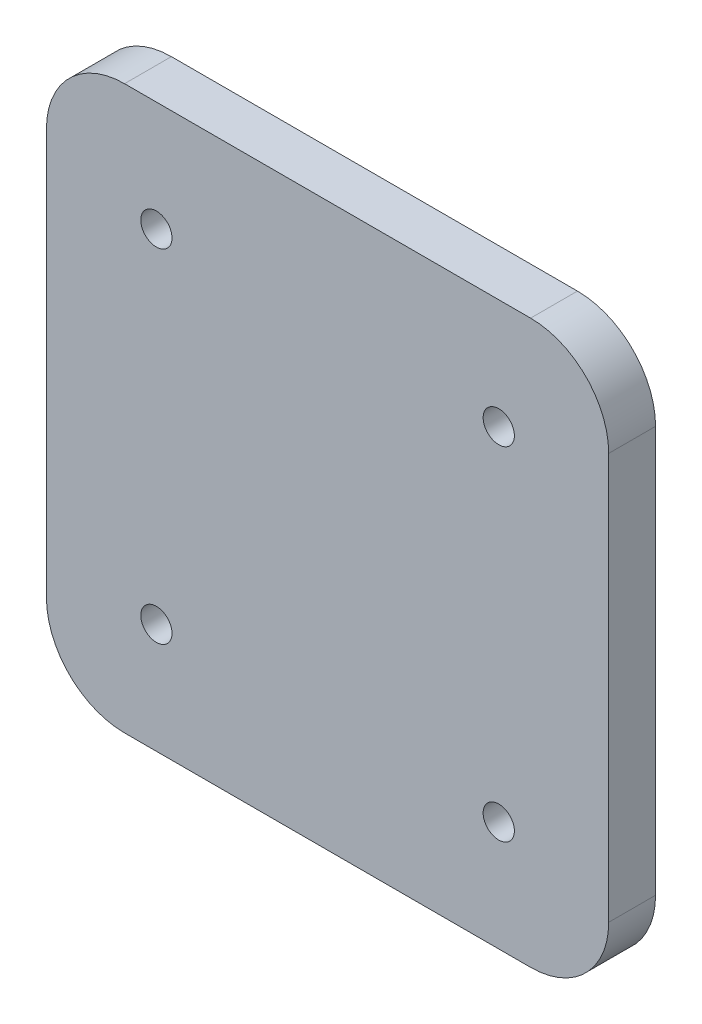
ISO-10303-21;
HEADER;
FILE_DESCRIPTION(('STEP AP214'),'2;1');
FILE_NAME('part.step','',(''),(''),'','','');
FILE_SCHEMA(('AUTOMOTIVE_DESIGN { 1 0 10303 214 1 1 1 1 }'));
ENDSEC;
DATA;
#1=APPLICATION_CONTEXT('core data for automotive mechanical design processes');
#2=APPLICATION_PROTOCOL_DEFINITION('international standard','automotive_design',2000,#1);
#3=PRODUCT_CONTEXT('',#1,'mechanical');
#4=PRODUCT('Part','Part','',(#3));
#5=PRODUCT_RELATED_PRODUCT_CATEGORY('part','',(#4));
#6=PRODUCT_DEFINITION_FORMATION('','',#4);
#7=PRODUCT_DEFINITION_CONTEXT('part definition',#1,'design');
#8=PRODUCT_DEFINITION('design','',#6,#7);
#9=PRODUCT_DEFINITION_SHAPE('','',#8);
#10=(LENGTH_UNIT() NAMED_UNIT(*) SI_UNIT(.MILLI.,.METRE.));
#11=(NAMED_UNIT(*) PLANE_ANGLE_UNIT() SI_UNIT($,.RADIAN.));
#12=(NAMED_UNIT(*) SI_UNIT($,.STERADIAN.) SOLID_ANGLE_UNIT());
#13=UNCERTAINTY_MEASURE_WITH_UNIT(LENGTH_MEASURE(1.E-05),#10,'distance_accuracy_value','');
#14=(GEOMETRIC_REPRESENTATION_CONTEXT(3) GLOBAL_UNCERTAINTY_ASSIGNED_CONTEXT((#13)) GLOBAL_UNIT_ASSIGNED_CONTEXT((#10,
#11,#12)) REPRESENTATION_CONTEXT('',''));
#15=CARTESIAN_POINT('',(0.,0.,0.));
#16=DIRECTION('',(0.,0.,1.));
#17=DIRECTION('',(1.,0.,0.));
#18=AXIS2_PLACEMENT_3D('',#15,#16,#17);
#19=CARTESIAN_POINT('',(-13.,13.,3.));
#20=DIRECTION('',(0.,0.,1.));
#21=DIRECTION('',(1.,0.,0.));
#22=AXIS2_PLACEMENT_3D('',#19,#20,#21);
#23=PLANE('',#22);
#24=CARTESIAN_POINT('',(-10.9601551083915,-10.9601551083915,3.));
#25=DIRECTION('',(0.,0.,1.));
#26=DIRECTION('',(1.,0.,0.));
#27=AXIS2_PLACEMENT_3D('',#24,#25,#26);
#28=CIRCLE('',#27,1.);
#29=CARTESIAN_POINT('',(-9.96015510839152,-10.9601551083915,3.));
#30=VERTEX_POINT('',#29);
#31=EDGE_CURVE('E188',#30,#30,#28,.T.);
#32=ORIENTED_EDGE('',*,*,#31,.F.);
#33=EDGE_LOOP('',(#32));
#34=FACE_BOUND('',#33,.T.);
#35=CARTESIAN_POINT('',(10.9601551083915,10.9601551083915,3.));
#36=DIRECTION('',(0.,0.,1.));
#37=DIRECTION('',(1.,0.,0.));
#38=AXIS2_PLACEMENT_3D('',#35,#36,#37);
#39=CIRCLE('',#38,1.);
#40=CARTESIAN_POINT('',(11.9601551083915,10.9601551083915,3.));
#41=VERTEX_POINT('',#40);
#42=EDGE_CURVE('E134',#41,#41,#39,.T.);
#43=ORIENTED_EDGE('',*,*,#42,.F.);
#44=EDGE_LOOP('',(#43));
#45=FACE_BOUND('',#44,.T.);
#46=CARTESIAN_POINT('',(-13.,13.,3.));
#47=DIRECTION('',(0.,0.,1.));
#48=DIRECTION('',(1.,0.,0.));
#49=AXIS2_PLACEMENT_3D('',#46,#47,#48);
#50=CIRCLE('',#49,5.);
#51=CARTESIAN_POINT('',(-13.,18.,3.));
#52=VERTEX_POINT('',#51);
#53=CARTESIAN_POINT('',(-18.,13.,3.));
#54=VERTEX_POINT('',#53);
#55=EDGE_CURVE('E145',#52,#54,#50,.T.);
#56=ORIENTED_EDGE('',*,*,#55,.T.);
#57=DIRECTION('',(0.,-1.,0.));
#58=VECTOR('',#57,1.);
#59=CARTESIAN_POINT('',(-18.,13.,3.));
#60=LINE('',#59,#58);
#61=CARTESIAN_POINT('',(-18.,-13.,3.));
#62=VERTEX_POINT('',#61);
#63=EDGE_CURVE('E93',#54,#62,#60,.T.);
#64=ORIENTED_EDGE('',*,*,#63,.T.);
#65=CARTESIAN_POINT('',(-13.,-13.,3.));
#66=DIRECTION('',(0.,0.,1.));
#67=DIRECTION('',(1.,0.,0.));
#68=AXIS2_PLACEMENT_3D('',#65,#66,#67);
#69=CIRCLE('',#68,5.);
#70=CARTESIAN_POINT('',(-13.,-18.,3.));
#71=VERTEX_POINT('',#70);
#72=EDGE_CURVE('E160',#62,#71,#69,.T.);
#73=ORIENTED_EDGE('',*,*,#72,.T.);
#74=DIRECTION('',(1.,0.,0.));
#75=VECTOR('',#74,1.);
#76=CARTESIAN_POINT('',(-13.,-18.,3.));
#77=LINE('',#76,#75);
#78=CARTESIAN_POINT('',(13.,-18.,3.));
#79=VERTEX_POINT('',#78);
#80=EDGE_CURVE('E173',#71,#79,#77,.T.);
#81=ORIENTED_EDGE('',*,*,#80,.T.);
#82=CARTESIAN_POINT('',(13.,-13.,3.));
#83=DIRECTION('',(0.,0.,1.));
#84=DIRECTION('',(1.,0.,0.));
#85=AXIS2_PLACEMENT_3D('',#82,#83,#84);
#86=CIRCLE('',#85,5.);
#87=CARTESIAN_POINT('',(18.,-13.,3.));
#88=VERTEX_POINT('',#87);
#89=EDGE_CURVE('E112',#79,#88,#86,.T.);
#90=ORIENTED_EDGE('',*,*,#89,.T.);
#91=DIRECTION('',(0.,1.,0.));
#92=VECTOR('',#91,1.);
#93=CARTESIAN_POINT('',(18.,13.,3.));
#94=LINE('',#93,#92);
#95=CARTESIAN_POINT('',(18.,13.,3.));
#96=VERTEX_POINT('',#95);
#97=EDGE_CURVE('E106',#88,#96,#94,.T.);
#98=ORIENTED_EDGE('',*,*,#97,.T.);
#99=CARTESIAN_POINT('',(13.,13.,3.));
#100=DIRECTION('',(0.,0.,1.));
#101=DIRECTION('',(1.,0.,0.));
#102=AXIS2_PLACEMENT_3D('',#99,#100,#101);
#103=CIRCLE('',#102,5.);
#104=CARTESIAN_POINT('',(13.,18.,3.));
#105=VERTEX_POINT('',#104);
#106=EDGE_CURVE('E110',#96,#105,#103,.T.);
#107=ORIENTED_EDGE('',*,*,#106,.T.);
#108=DIRECTION('',(-1.,0.,0.));
#109=VECTOR('',#108,1.);
#110=CARTESIAN_POINT('',(-13.,18.,3.));
#111=LINE('',#110,#109);
#112=EDGE_CURVE('E50',#105,#52,#111,.T.);
#113=ORIENTED_EDGE('',*,*,#112,.T.);
#114=EDGE_LOOP('',(#56,#64,#73,#81,#90,#98,#107,#113));
#115=FACE_BOUND('',#114,.T.);
#116=CARTESIAN_POINT('',(10.9601551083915,-10.9601551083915,3.));
#117=DIRECTION('',(0.,0.,1.));
#118=DIRECTION('',(1.,0.,0.));
#119=AXIS2_PLACEMENT_3D('',#116,#117,#118);
#120=CIRCLE('',#119,1.);
#121=CARTESIAN_POINT('',(11.9601551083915,-10.9601551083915,3.));
#122=VERTEX_POINT('',#121);
#123=EDGE_CURVE('E182',#122,#122,#120,.T.);
#124=ORIENTED_EDGE('',*,*,#123,.F.);
#125=EDGE_LOOP('',(#124));
#126=FACE_BOUND('',#125,.T.);
#127=CARTESIAN_POINT('',(-10.9601551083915,10.9601551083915,3.));
#128=DIRECTION('',(0.,0.,1.));
#129=DIRECTION('',(1.,0.,0.));
#130=AXIS2_PLACEMENT_3D('',#127,#128,#129);
#131=CIRCLE('',#130,1.);
#132=CARTESIAN_POINT('',(-9.96015510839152,10.9601551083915,3.));
#133=VERTEX_POINT('',#132);
#134=EDGE_CURVE('E194',#133,#133,#131,.T.);
#135=ORIENTED_EDGE('',*,*,#134,.F.);
#136=EDGE_LOOP('',(#135));
#137=FACE_BOUND('',#136,.T.);
#138=ADVANCED_FACE('F33',(#34,#45,#115,#126,#137),#23,.T.);
#139=CARTESIAN_POINT('',(-13.,13.,0.));
#140=DIRECTION('',(0.,0.,1.));
#141=DIRECTION('',(1.,0.,0.));
#142=AXIS2_PLACEMENT_3D('',#139,#140,#141);
#143=PLANE('',#142);
#144=CARTESIAN_POINT('',(-10.9601551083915,-10.9601551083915,0.));
#145=DIRECTION('',(0.,0.,1.));
#146=DIRECTION('',(1.,0.,0.));
#147=AXIS2_PLACEMENT_3D('',#144,#145,#146);
#148=CIRCLE('',#147,1.);
#149=CARTESIAN_POINT('',(-9.96015510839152,-10.9601551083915,0.));
#150=VERTEX_POINT('',#149);
#151=EDGE_CURVE('E191',#150,#150,#148,.T.);
#152=ORIENTED_EDGE('',*,*,#151,.T.);
#153=EDGE_LOOP('',(#152));
#154=FACE_BOUND('',#153,.T.);
#155=CARTESIAN_POINT('',(10.9601551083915,10.9601551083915,0.));
#156=DIRECTION('',(0.,0.,1.));
#157=DIRECTION('',(1.,0.,0.));
#158=AXIS2_PLACEMENT_3D('',#155,#156,#157);
#159=CIRCLE('',#158,1.);
#160=CARTESIAN_POINT('',(11.9601551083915,10.9601551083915,0.));
#161=VERTEX_POINT('',#160);
#162=EDGE_CURVE('E179',#161,#161,#159,.T.);
#163=ORIENTED_EDGE('',*,*,#162,.T.);
#164=EDGE_LOOP('',(#163));
#165=FACE_BOUND('',#164,.T.);
#166=CARTESIAN_POINT('',(-13.,13.,0.));
#167=DIRECTION('',(0.,0.,1.));
#168=DIRECTION('',(1.,0.,0.));
#169=AXIS2_PLACEMENT_3D('',#166,#167,#168);
#170=CIRCLE('',#169,5.);
#171=CARTESIAN_POINT('',(-13.,18.,0.));
#172=VERTEX_POINT('',#171);
#173=CARTESIAN_POINT('',(-18.,13.,0.));
#174=VERTEX_POINT('',#173);
#175=EDGE_CURVE('E130',#172,#174,#170,.T.);
#176=ORIENTED_EDGE('',*,*,#175,.F.);
#177=DIRECTION('',(-1.,0.,0.));
#178=VECTOR('',#177,1.);
#179=CARTESIAN_POINT('',(-13.,18.,0.));
#180=LINE('',#179,#178);
#181=CARTESIAN_POINT('',(13.,18.,0.));
#182=VERTEX_POINT('',#181);
#183=EDGE_CURVE('E85',#182,#172,#180,.T.);
#184=ORIENTED_EDGE('',*,*,#183,.F.);
#185=CARTESIAN_POINT('',(13.,13.,0.));
#186=DIRECTION('',(0.,0.,1.));
#187=DIRECTION('',(1.,0.,0.));
#188=AXIS2_PLACEMENT_3D('',#185,#186,#187);
#189=CIRCLE('',#188,5.);
#190=CARTESIAN_POINT('',(18.,13.,0.));
#191=VERTEX_POINT('',#190);
#192=EDGE_CURVE('E79',#191,#182,#189,.T.);
#193=ORIENTED_EDGE('',*,*,#192,.F.);
#194=DIRECTION('',(0.,1.,0.));
#195=VECTOR('',#194,1.);
#196=CARTESIAN_POINT('',(18.,13.,0.));
#197=LINE('',#196,#195);
#198=CARTESIAN_POINT('',(18.,-13.,0.));
#199=VERTEX_POINT('',#198);
#200=EDGE_CURVE('E120',#199,#191,#197,.T.);
#201=ORIENTED_EDGE('',*,*,#200,.F.);
#202=CARTESIAN_POINT('',(13.,-13.,0.));
#203=DIRECTION('',(0.,0.,1.));
#204=DIRECTION('',(1.,0.,0.));
#205=AXIS2_PLACEMENT_3D('',#202,#203,#204);
#206=CIRCLE('',#205,5.);
#207=CARTESIAN_POINT('',(13.,-18.,0.));
#208=VERTEX_POINT('',#207);
#209=EDGE_CURVE('E140',#208,#199,#206,.T.);
#210=ORIENTED_EDGE('',*,*,#209,.F.);
#211=DIRECTION('',(1.,0.,0.));
#212=VECTOR('',#211,1.);
#213=CARTESIAN_POINT('',(-13.,-18.,0.));
#214=LINE('',#213,#212);
#215=CARTESIAN_POINT('',(-13.,-18.,0.));
#216=VERTEX_POINT('',#215);
#217=EDGE_CURVE('E138',#216,#208,#214,.T.);
#218=ORIENTED_EDGE('',*,*,#217,.F.);
#219=CARTESIAN_POINT('',(-13.,-13.,0.));
#220=DIRECTION('',(0.,0.,1.));
#221=DIRECTION('',(1.,0.,0.));
#222=AXIS2_PLACEMENT_3D('',#219,#220,#221);
#223=CIRCLE('',#222,5.);
#224=CARTESIAN_POINT('',(-18.,-13.,0.));
#225=VERTEX_POINT('',#224);
#226=EDGE_CURVE('E136',#225,#216,#223,.T.);
#227=ORIENTED_EDGE('',*,*,#226,.F.);
#228=DIRECTION('',(0.,-1.,0.));
#229=VECTOR('',#228,1.);
#230=CARTESIAN_POINT('',(-18.,13.,0.));
#231=LINE('',#230,#229);
#232=EDGE_CURVE('E133',#174,#225,#231,.T.);
#233=ORIENTED_EDGE('',*,*,#232,.F.);
#234=EDGE_LOOP('',(#176,#184,#193,#201,#210,#218,#227,#233));
#235=FACE_BOUND('',#234,.T.);
#236=CARTESIAN_POINT('',(10.9601551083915,-10.9601551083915,0.));
#237=DIRECTION('',(0.,0.,1.));
#238=DIRECTION('',(1.,0.,0.));
#239=AXIS2_PLACEMENT_3D('',#236,#237,#238);
#240=CIRCLE('',#239,1.);
#241=CARTESIAN_POINT('',(11.9601551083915,-10.9601551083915,0.));
#242=VERTEX_POINT('',#241);
#243=EDGE_CURVE('E185',#242,#242,#240,.T.);
#244=ORIENTED_EDGE('',*,*,#243,.T.);
#245=EDGE_LOOP('',(#244));
#246=FACE_BOUND('',#245,.T.);
#247=CARTESIAN_POINT('',(-10.9601551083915,10.9601551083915,0.));
#248=DIRECTION('',(0.,0.,1.));
#249=DIRECTION('',(1.,0.,0.));
#250=AXIS2_PLACEMENT_3D('',#247,#248,#249);
#251=CIRCLE('',#250,1.);
#252=CARTESIAN_POINT('',(-9.96015510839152,10.9601551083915,0.));
#253=VERTEX_POINT('',#252);
#254=EDGE_CURVE('E197',#253,#253,#251,.T.);
#255=ORIENTED_EDGE('',*,*,#254,.T.);
#256=EDGE_LOOP('',(#255));
#257=FACE_BOUND('',#256,.T.);
#258=ADVANCED_FACE('F164',(#154,#165,#235,#246,#257),#143,.F.);
#259=CARTESIAN_POINT('',(-13.,13.,3.));
#260=DIRECTION('',(0.,0.,-1.));
#261=DIRECTION('',(-1.,0.,0.));
#262=AXIS2_PLACEMENT_3D('',#259,#260,#261);
#263=CYLINDRICAL_SURFACE('',#262,5.);
#264=ORIENTED_EDGE('',*,*,#175,.T.);
#265=DIRECTION('',(0.,0.,-1.));
#266=VECTOR('',#265,1.);
#267=CARTESIAN_POINT('',(-18.,13.,3.));
#268=LINE('',#267,#266);
#269=EDGE_CURVE('E11',#54,#174,#268,.T.);
#270=ORIENTED_EDGE('',*,*,#269,.F.);
#271=ORIENTED_EDGE('',*,*,#55,.F.);
#272=DIRECTION('',(0.,0.,-1.));
#273=VECTOR('',#272,1.);
#274=CARTESIAN_POINT('',(-13.,18.,3.));
#275=LINE('',#274,#273);
#276=EDGE_CURVE('E126',#52,#172,#275,.T.);
#277=ORIENTED_EDGE('',*,*,#276,.T.);
#278=EDGE_LOOP('',(#264,#270,#271,#277));
#279=FACE_BOUND('',#278,.T.);
#280=ADVANCED_FACE('F35',(#279),#263,.T.);
#281=CARTESIAN_POINT('',(-18.,13.,3.));
#282=DIRECTION('',(1.,0.,0.));
#283=DIRECTION('',(0.,1.,0.));
#284=AXIS2_PLACEMENT_3D('',#281,#282,#283);
#285=PLANE('',#284);
#286=ORIENTED_EDGE('',*,*,#232,.T.);
#287=DIRECTION('',(0.,0.,-1.));
#288=VECTOR('',#287,1.);
#289=CARTESIAN_POINT('',(-18.,-13.,3.));
#290=LINE('',#289,#288);
#291=EDGE_CURVE('E42',#62,#225,#290,.T.);
#292=ORIENTED_EDGE('',*,*,#291,.F.);
#293=ORIENTED_EDGE('',*,*,#63,.F.);
#294=ORIENTED_EDGE('',*,*,#269,.T.);
#295=EDGE_LOOP('',(#286,#292,#293,#294));
#296=FACE_BOUND('',#295,.T.);
#297=ADVANCED_FACE('F232',(#296),#285,.F.);
#298=CARTESIAN_POINT('',(-13.,-13.,3.));
#299=DIRECTION('',(0.,0.,-1.));
#300=DIRECTION('',(-1.,0.,0.));
#301=AXIS2_PLACEMENT_3D('',#298,#299,#300);
#302=CYLINDRICAL_SURFACE('',#301,5.);
#303=ORIENTED_EDGE('',*,*,#226,.T.);
#304=DIRECTION('',(0.,0.,-1.));
#305=VECTOR('',#304,1.);
#306=CARTESIAN_POINT('',(-13.,-18.,3.));
#307=LINE('',#306,#305);
#308=EDGE_CURVE('E152',#71,#216,#307,.T.);
#309=ORIENTED_EDGE('',*,*,#308,.F.);
#310=ORIENTED_EDGE('',*,*,#72,.F.);
#311=ORIENTED_EDGE('',*,*,#291,.T.);
#312=EDGE_LOOP('',(#303,#309,#310,#311));
#313=FACE_BOUND('',#312,.T.);
#314=ADVANCED_FACE('F158',(#313),#302,.T.);
#315=CARTESIAN_POINT('',(-13.,-18.,3.));
#316=DIRECTION('',(0.,1.,0.));
#317=DIRECTION('',(0.,0.,1.));
#318=AXIS2_PLACEMENT_3D('',#315,#316,#317);
#319=PLANE('',#318);
#320=ORIENTED_EDGE('',*,*,#217,.T.);
#321=DIRECTION('',(0.,0.,-1.));
#322=VECTOR('',#321,1.);
#323=CARTESIAN_POINT('',(13.,-18.,3.));
#324=LINE('',#323,#322);
#325=EDGE_CURVE('E149',#79,#208,#324,.T.);
#326=ORIENTED_EDGE('',*,*,#325,.F.);
#327=ORIENTED_EDGE('',*,*,#80,.F.);
#328=ORIENTED_EDGE('',*,*,#308,.T.);
#329=EDGE_LOOP('',(#320,#326,#327,#328));
#330=FACE_BOUND('',#329,.T.);
#331=ADVANCED_FACE('F169',(#330),#319,.F.);
#332=CARTESIAN_POINT('',(13.,-13.,3.));
#333=DIRECTION('',(0.,0.,-1.));
#334=DIRECTION('',(-1.,0.,0.));
#335=AXIS2_PLACEMENT_3D('',#332,#333,#334);
#336=CYLINDRICAL_SURFACE('',#335,5.);
#337=ORIENTED_EDGE('',*,*,#209,.T.);
#338=DIRECTION('',(0.,0.,-1.));
#339=VECTOR('',#338,1.);
#340=CARTESIAN_POINT('',(18.,-13.,3.));
#341=LINE('',#340,#339);
#342=EDGE_CURVE('E121',#88,#199,#341,.T.);
#343=ORIENTED_EDGE('',*,*,#342,.F.);
#344=ORIENTED_EDGE('',*,*,#89,.F.);
#345=ORIENTED_EDGE('',*,*,#325,.T.);
#346=EDGE_LOOP('',(#337,#343,#344,#345));
#347=FACE_BOUND('',#346,.T.);
#348=ADVANCED_FACE('F172',(#347),#336,.T.);
#349=CARTESIAN_POINT('',(18.,13.,3.));
#350=DIRECTION('',(-1.,0.,0.));
#351=DIRECTION('',(0.,-1.,0.));
#352=AXIS2_PLACEMENT_3D('',#349,#350,#351);
#353=PLANE('',#352);
#354=ORIENTED_EDGE('',*,*,#200,.T.);
#355=DIRECTION('',(0.,0.,-1.));
#356=VECTOR('',#355,1.);
#357=CARTESIAN_POINT('',(18.,13.,3.));
#358=LINE('',#357,#356);
#359=EDGE_CURVE('E117',#96,#191,#358,.T.);
#360=ORIENTED_EDGE('',*,*,#359,.F.);
#361=ORIENTED_EDGE('',*,*,#97,.F.);
#362=ORIENTED_EDGE('',*,*,#342,.T.);
#363=EDGE_LOOP('',(#354,#360,#361,#362));
#364=FACE_BOUND('',#363,.T.);
#365=ADVANCED_FACE('F118',(#364),#353,.F.);
#366=CARTESIAN_POINT('',(13.,13.,3.));
#367=DIRECTION('',(0.,0.,-1.));
#368=DIRECTION('',(-1.,0.,0.));
#369=AXIS2_PLACEMENT_3D('',#366,#367,#368);
#370=CYLINDRICAL_SURFACE('',#369,5.);
#371=ORIENTED_EDGE('',*,*,#192,.T.);
#372=DIRECTION('',(0.,0.,-1.));
#373=VECTOR('',#372,1.);
#374=CARTESIAN_POINT('',(13.,18.,3.));
#375=LINE('',#374,#373);
#376=EDGE_CURVE('E122',#105,#182,#375,.T.);
#377=ORIENTED_EDGE('',*,*,#376,.F.);
#378=ORIENTED_EDGE('',*,*,#106,.F.);
#379=ORIENTED_EDGE('',*,*,#359,.T.);
#380=EDGE_LOOP('',(#371,#377,#378,#379));
#381=FACE_BOUND('',#380,.T.);
#382=ADVANCED_FACE('F124',(#381),#370,.T.);
#383=CARTESIAN_POINT('',(-13.,18.,3.));
#384=DIRECTION('',(0.,-1.,0.));
#385=DIRECTION('',(0.,0.,-1.));
#386=AXIS2_PLACEMENT_3D('',#383,#384,#385);
#387=PLANE('',#386);
#388=ORIENTED_EDGE('',*,*,#183,.T.);
#389=ORIENTED_EDGE('',*,*,#276,.F.);
#390=ORIENTED_EDGE('',*,*,#112,.F.);
#391=ORIENTED_EDGE('',*,*,#376,.T.);
#392=EDGE_LOOP('',(#388,#389,#390,#391));
#393=FACE_BOUND('',#392,.T.);
#394=ADVANCED_FACE('F220',(#393),#387,.F.);
#395=CARTESIAN_POINT('',(10.9601551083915,10.9601551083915,3.));
#396=DIRECTION('',(0.,0.,-1.));
#397=DIRECTION('',(-1.,0.,0.));
#398=AXIS2_PLACEMENT_3D('',#395,#396,#397);
#399=CYLINDRICAL_SURFACE('',#398,1.);
#400=ORIENTED_EDGE('',*,*,#42,.T.);
#401=EDGE_LOOP('',(#400));
#402=FACE_BOUND('',#401,.T.);
#403=ORIENTED_EDGE('',*,*,#162,.F.);
#404=EDGE_LOOP('',(#403));
#405=FACE_BOUND('',#404,.T.);
#406=ADVANCED_FACE('F217',(#402,#405),#399,.F.);
#407=CARTESIAN_POINT('',(10.9601551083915,-10.9601551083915,3.));
#408=DIRECTION('',(0.,0.,-1.));
#409=DIRECTION('',(-1.,0.,0.));
#410=AXIS2_PLACEMENT_3D('',#407,#408,#409);
#411=CYLINDRICAL_SURFACE('',#410,1.);
#412=ORIENTED_EDGE('',*,*,#123,.T.);
#413=EDGE_LOOP('',(#412));
#414=FACE_BOUND('',#413,.T.);
#415=ORIENTED_EDGE('',*,*,#243,.F.);
#416=EDGE_LOOP('',(#415));
#417=FACE_BOUND('',#416,.T.);
#418=ADVANCED_FACE('F296',(#414,#417),#411,.F.);
#419=CARTESIAN_POINT('',(-10.9601551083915,-10.9601551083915,3.));
#420=DIRECTION('',(0.,0.,-1.));
#421=DIRECTION('',(-1.,0.,0.));
#422=AXIS2_PLACEMENT_3D('',#419,#420,#421);
#423=CYLINDRICAL_SURFACE('',#422,1.);
#424=ORIENTED_EDGE('',*,*,#31,.T.);
#425=EDGE_LOOP('',(#424));
#426=FACE_BOUND('',#425,.T.);
#427=ORIENTED_EDGE('',*,*,#151,.F.);
#428=EDGE_LOOP('',(#427));
#429=FACE_BOUND('',#428,.T.);
#430=ADVANCED_FACE('F304',(#426,#429),#423,.F.);
#431=CARTESIAN_POINT('',(-10.9601551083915,10.9601551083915,3.));
#432=DIRECTION('',(0.,0.,-1.));
#433=DIRECTION('',(-1.,0.,0.));
#434=AXIS2_PLACEMENT_3D('',#431,#432,#433);
#435=CYLINDRICAL_SURFACE('',#434,1.);
#436=ORIENTED_EDGE('',*,*,#134,.T.);
#437=EDGE_LOOP('',(#436));
#438=FACE_BOUND('',#437,.T.);
#439=ORIENTED_EDGE('',*,*,#254,.F.);
#440=EDGE_LOOP('',(#439));
#441=FACE_BOUND('',#440,.T.);
#442=ADVANCED_FACE('F203',(#438,#441),#435,.F.);
#443=CLOSED_SHELL('',(#138,#258,#280,#297,#314,#331,#348,#365,#382,#394,#406,#418,#430,#442));
#444=MANIFOLD_SOLID_BREP('B2',#443);
#445=ADVANCED_BREP_SHAPE_REPRESENTATION('',(#18,#444),#14);
#446=SHAPE_DEFINITION_REPRESENTATION(#9,#445);
ENDSEC;
END-ISO-10303-21;
